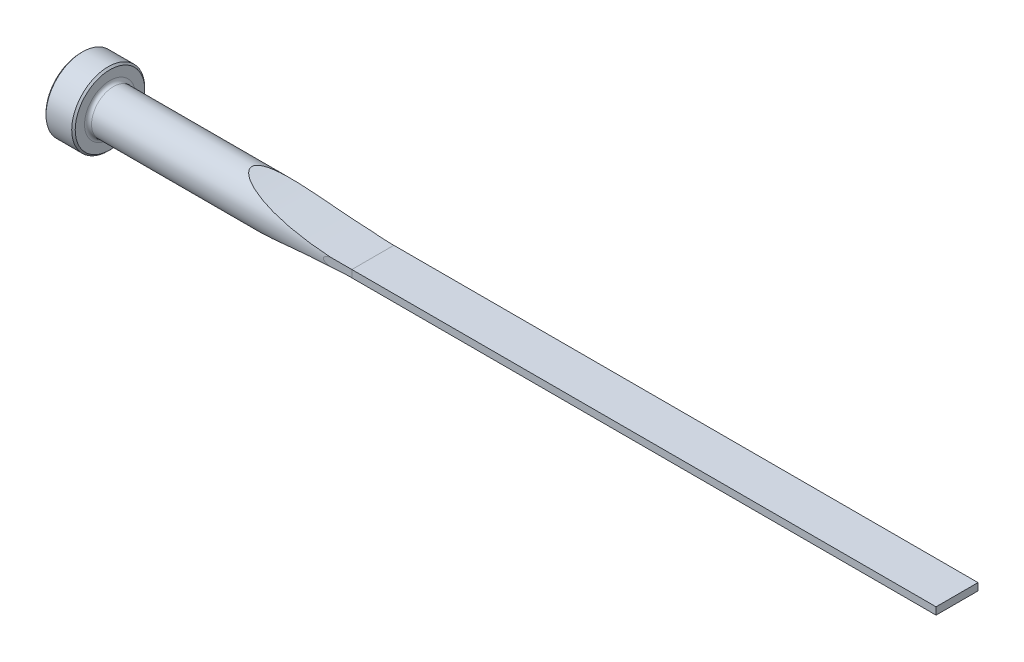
ISO-10303-21;
HEADER;
FILE_DESCRIPTION(('STEP AP214'),'2;1');
FILE_NAME('part.step','',(''),(''),'','','');
FILE_SCHEMA(('AUTOMOTIVE_DESIGN { 1 0 10303 214 1 1 1 1 }'));
ENDSEC;
DATA;
#1=APPLICATION_CONTEXT('core data for automotive mechanical design processes');
#2=APPLICATION_PROTOCOL_DEFINITION('international standard','automotive_design',2000,#1);
#3=PRODUCT_CONTEXT('',#1,'mechanical');
#4=PRODUCT('Part','Part','',(#3));
#5=PRODUCT_RELATED_PRODUCT_CATEGORY('part','',(#4));
#6=PRODUCT_DEFINITION_FORMATION('','',#4);
#7=PRODUCT_DEFINITION_CONTEXT('part definition',#1,'design');
#8=PRODUCT_DEFINITION('design','',#6,#7);
#9=PRODUCT_DEFINITION_SHAPE('','',#8);
#10=(LENGTH_UNIT() NAMED_UNIT(*) SI_UNIT(.MILLI.,.METRE.));
#11=(NAMED_UNIT(*) PLANE_ANGLE_UNIT() SI_UNIT($,.RADIAN.));
#12=(NAMED_UNIT(*) SI_UNIT($,.STERADIAN.) SOLID_ANGLE_UNIT());
#13=UNCERTAINTY_MEASURE_WITH_UNIT(LENGTH_MEASURE(1.E-05),#10,'distance_accuracy_value','');
#14=(GEOMETRIC_REPRESENTATION_CONTEXT(3) GLOBAL_UNCERTAINTY_ASSIGNED_CONTEXT((#13)) GLOBAL_UNIT_ASSIGNED_CONTEXT((#10,
#11,#12)) REPRESENTATION_CONTEXT('',''));
#15=CARTESIAN_POINT('',(0.,0.,0.));
#16=DIRECTION('',(0.,0.,1.));
#17=DIRECTION('',(1.,0.,0.));
#18=AXIS2_PLACEMENT_3D('',#15,#16,#17);
#19=CARTESIAN_POINT('',(0.,0.,0.));
#20=DIRECTION('',(-1.,0.,0.));
#21=DIRECTION('',(0.,0.,1.));
#22=AXIS2_PLACEMENT_3D('',#19,#20,#21);
#23=CYLINDRICAL_SURFACE('',#22,4.7625);
#24=CARTESIAN_POINT('',(7.112,0.,0.));
#25=DIRECTION('',(-1.,0.,0.));
#26=DIRECTION('',(0.,0.,1.));
#27=AXIS2_PLACEMENT_3D('',#24,#25,#26);
#28=CIRCLE('',#27,4.7625);
#29=CARTESIAN_POINT('',(7.112,0.,4.7625));
#30=VERTEX_POINT('',#29);
#31=EDGE_CURVE('E153',#30,#30,#28,.F.);
#32=ORIENTED_EDGE('',*,*,#31,.T.);
#33=EDGE_LOOP('',(#32));
#34=FACE_BOUND('',#33,.T.);
#35=CARTESIAN_POINT('',(63.5,1.37629566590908,4.55929999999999));
#36=CARTESIAN_POINT('',(63.300243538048,1.37627017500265,4.55929946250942));
#37=CARTESIAN_POINT('',(63.1004832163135,1.37406392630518,4.55997325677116));
#38=CARTESIAN_POINT('',(62.7010249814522,1.36511039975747,4.56266611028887));
#39=CARTESIAN_POINT('',(62.5013270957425,1.35836200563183,4.56468550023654));
#40=CARTESIAN_POINT('',(62.1003478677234,1.34006170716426,4.57009060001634));
#41=CARTESIAN_POINT('',(61.8990686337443,1.32846669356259,4.57348856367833));
#42=CARTESIAN_POINT('',(61.4969284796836,1.30007175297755,4.58164172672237));
#43=CARTESIAN_POINT('',(61.296067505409,1.28327254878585,4.58639673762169));
#44=CARTESIAN_POINT('',(60.8961767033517,1.2439534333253,4.59721659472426));
#45=CARTESIAN_POINT('',(60.6971431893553,1.22146913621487,4.6032732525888));
#46=CARTESIAN_POINT('',(60.2999040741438,1.16973426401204,4.61669265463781));
#47=CARTESIAN_POINT('',(60.1016988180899,1.14048110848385,4.62405589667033));
#48=CARTESIAN_POINT('',(59.7074850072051,1.07370926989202,4.64001372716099));
#49=CARTESIAN_POINT('',(59.5114710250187,1.03622172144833,4.64860363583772));
#50=CARTESIAN_POINT('',(59.1219644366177,0.950234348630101,4.66695416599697));
#51=CARTESIAN_POINT('',(58.9284697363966,0.901744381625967,4.67671373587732));
#52=CARTESIAN_POINT('',(58.689568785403,0.830609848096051,4.68952997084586));
#53=CARTESIAN_POINT('',(58.6417966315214,0.815810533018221,4.69213189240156));
#54=CARTESIAN_POINT('',(58.5466454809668,0.784967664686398,4.69739068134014));
#55=CARTESIAN_POINT('',(58.4992665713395,0.768923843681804,4.70004756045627));
#56=CARTESIAN_POINT('',(58.3571752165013,0.718404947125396,4.70812874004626));
#57=CARTESIAN_POINT('',(58.263234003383,0.681752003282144,4.71362458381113));
#58=CARTESIAN_POINT('',(58.0775344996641,0.599731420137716,4.72477713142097));
#59=CARTESIAN_POINT('',(57.9858203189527,0.554256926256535,4.73043499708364));
#60=CARTESIAN_POINT('',(57.8546141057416,0.476034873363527,4.73871868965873));
#61=CARTESIAN_POINT('',(57.8120990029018,0.448424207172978,4.7414354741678));
#62=CARTESIAN_POINT('',(57.7304247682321,0.388667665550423,4.74670987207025));
#63=CARTESIAN_POINT('',(57.6912549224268,0.356537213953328,4.74926798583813));
#64=CARTESIAN_POINT('',(57.6343845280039,0.30109449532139,4.75301502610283));
#65=CARTESIAN_POINT('',(57.6146643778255,0.279884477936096,4.75432176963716));
#66=CARTESIAN_POINT('',(57.578171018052,0.235020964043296,4.75675058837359));
#67=CARTESIAN_POINT('',(57.5613938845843,0.211370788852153,4.75787290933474));
#68=CARTESIAN_POINT('',(57.5361358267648,0.168085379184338,4.75956809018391));
#69=CARTESIAN_POINT('',(57.526635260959,0.149056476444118,4.76020769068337));
#70=CARTESIAN_POINT('',(57.51078402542,0.10971358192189,4.76127659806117));
#71=CARTESIAN_POINT('',(57.5044294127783,0.089401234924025,4.76170616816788));
#72=CARTESIAN_POINT('',(57.4955459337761,0.0476995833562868,4.76230708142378));
#73=CARTESIAN_POINT('',(57.4930580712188,0.0263011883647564,4.76247565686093));
#74=CARTESIAN_POINT('',(57.4924127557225,-0.0165581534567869,4.76251936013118));
#75=CARTESIAN_POINT('',(57.4942536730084,-0.0380190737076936,4.76239459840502));
#76=CARTESIAN_POINT('',(57.5014223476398,-0.0771509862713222,4.76190953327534));
#77=CARTESIAN_POINT('',(57.5062147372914,-0.0949256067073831,4.76158540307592));
#78=CARTESIAN_POINT('',(57.5183183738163,-0.129583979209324,4.76076832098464));
#79=CARTESIAN_POINT('',(57.5256312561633,-0.146467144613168,4.76027525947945));
#80=CARTESIAN_POINT('',(57.5478239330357,-0.190109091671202,4.75878258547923));
#81=CARTESIAN_POINT('',(57.564497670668,-0.215945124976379,4.75766444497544));
#82=CARTESIAN_POINT('',(57.6015159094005,-0.264813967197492,4.75519504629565));
#83=CARTESIAN_POINT('',(57.6218718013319,-0.28783769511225,4.75384306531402));
#84=CARTESIAN_POINT('',(57.6862463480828,-0.353109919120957,4.74959319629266));
#85=CARTESIAN_POINT('',(57.7337556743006,-0.391849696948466,4.74648889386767));
#86=CARTESIAN_POINT('',(57.8332528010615,-0.462955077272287,4.74007706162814));
#87=CARTESIAN_POINT('',(57.8852557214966,-0.495297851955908,4.73676885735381));
#88=CARTESIAN_POINT('',(58.0324605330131,-0.578484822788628,4.72754240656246));
#89=CARTESIAN_POINT('',(58.1303120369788,-0.624585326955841,4.72156110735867));
#90=CARTESIAN_POINT('',(58.3296567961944,-0.708279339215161,4.70972175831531));
#91=CARTESIAN_POINT('',(58.431158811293,-0.745850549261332,4.70386406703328));
#92=CARTESIAN_POINT('',(58.637175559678,-0.815246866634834,4.69233729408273));
#93=CARTESIAN_POINT('',(58.7417096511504,-0.84701459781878,4.68667050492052));
#94=CARTESIAN_POINT('',(58.9519315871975,-0.905852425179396,4.67565197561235));
#95=CARTESIAN_POINT('',(59.0576177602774,-0.932928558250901,4.67029983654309));
#96=CARTESIAN_POINT('',(59.3472077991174,-1.00180171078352,4.65615804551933));
#97=CARTESIAN_POINT('',(59.5319939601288,-1.03994988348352,4.64770520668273));
#98=CARTESIAN_POINT('',(59.9031150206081,-1.10820041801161,4.63190013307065));
#99=CARTESIAN_POINT('',(60.0894504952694,-1.13829964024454,4.62454832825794));
#100=CARTESIAN_POINT('',(60.4634968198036,-1.19209136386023,4.61097562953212));
#101=CARTESIAN_POINT('',(60.6512097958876,-1.21576959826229,4.60475726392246));
#102=CARTESIAN_POINT('',(61.0272867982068,-1.25764094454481,4.59349611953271));
#103=CARTESIAN_POINT('',(61.2156508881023,-1.2758335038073,4.58845345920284));
#104=CARTESIAN_POINT('',(61.7534776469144,-1.32086317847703,4.57577149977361));
#105=CARTESIAN_POINT('',(62.1034775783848,-1.34186157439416,4.56957976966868));
#106=CARTESIAN_POINT('',(62.628033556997,-1.36263417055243,4.56340533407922));
#107=CARTESIAN_POINT('',(62.8023917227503,-1.36777128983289,4.56186604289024));
#108=CARTESIAN_POINT('',(63.151163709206,-1.37459791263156,4.55981341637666));
#109=CARTESIAN_POINT('',(63.3255775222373,-1.37628777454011,4.55929997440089));
#110=CARTESIAN_POINT('',(63.4999999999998,-1.37629566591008,4.55929999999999));
#111=B_SPLINE_CURVE_WITH_KNOTS('',3,(#35,#36,#37,#38,#39,#40,#41,#42,#43,#44,#45,#46,#47,#48,
#49,#50,#51,#52,#53,#54,#55,#56,#57,#58,#59,#60,#61,#62,#63,#64,#65,#66,#67,#68,#69,#70,#71,#72,
#73,#74,#75,#76,#77,#78,#79,#80,#81,#82,#83,#84,#85,#86,#87,#88,#89,#90,#91,#92,#93,#94,#95,#96,
#97,#98,#99,#100,#101,#102,#103,#104,#105,#106,#107,#108,#109,#110),.UNSPECIFIED.,.F.,.F.,(4,2,
2,2,2,2,2,2,2,2,2,2,2,2,2,2,2,2,2,2,2,2,2,2,2,2,2,2,2,2,2,2,2,2,2,2,2,4),(0.,0.599262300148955,
1.19867192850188,1.80353056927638,2.40830524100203,3.00938132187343,3.6106869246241,
4.20975694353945,4.80829234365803,4.95851786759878,5.10877580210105,5.41155733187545,
5.71826557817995,5.87039269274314,6.0220127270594,6.10881533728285,6.19550132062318,
6.25911958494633,6.32265791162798,6.38686552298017,6.45104896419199,6.50606849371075,
6.56112379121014,6.65289509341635,6.74495530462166,6.92807013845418,7.11182707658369,
7.43597686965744,7.76096456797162,8.08900931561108,8.41662876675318,8.98296372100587,
9.54951926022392,10.1173235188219,10.6851849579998,11.7368092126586,12.2601040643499,
12.7833445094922),.UNSPECIFIED.);
#112=CARTESIAN_POINT('',(58.9480485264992,0.904013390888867,4.67591339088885));
#113=VERTEX_POINT('',#112);
#114=CARTESIAN_POINT('',(58.9480485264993,-0.904013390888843,4.67591339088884));
#115=VERTEX_POINT('',#114);
#116=EDGE_CURVE('E156',#113,#115,#111,.T.);
#117=ORIENTED_EDGE('',*,*,#116,.F.);
#118=CARTESIAN_POINT('',(63.5,0.787399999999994,4.69695725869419));
#119=CARTESIAN_POINT('',(63.103126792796,0.787399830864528,4.69694748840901));
#120=CARTESIAN_POINT('',(62.7062538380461,0.79005762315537,4.69651148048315));
#121=CARTESIAN_POINT('',(61.9125803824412,0.800687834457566,4.69471601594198));
#122=CARTESIAN_POINT('',(61.5157798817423,0.808660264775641,4.69335655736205));
#123=CARTESIAN_POINT('',(60.7222838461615,0.829919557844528,4.68964302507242));
#124=CARTESIAN_POINT('',(60.3255883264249,0.843206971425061,4.68728884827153));
#125=CARTESIAN_POINT('',(59.5324224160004,0.875093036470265,4.68143945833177));
#126=CARTESIAN_POINT('',(59.1359520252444,0.893691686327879,4.67794424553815));
#127=CARTESIAN_POINT('',(57.9438636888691,0.957617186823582,4.66543915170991));
#128=CARTESIAN_POINT('',(57.1486795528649,1.01099038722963,4.65442159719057));
#129=CARTESIAN_POINT('',(55.5602326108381,1.13907993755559,4.62473906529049));
#130=CARTESIAN_POINT('',(54.7669696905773,1.21379498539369,4.60607455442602));
#131=CARTESIAN_POINT('',(53.182688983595,1.3845232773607,4.55767834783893));
#132=CARTESIAN_POINT('',(52.3916723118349,1.48054568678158,4.5279418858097));
#133=CARTESIAN_POINT('',(51.2077910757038,1.64042239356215,4.47141725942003));
#134=CARTESIAN_POINT('',(50.8135579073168,1.69636273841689,4.45058587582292));
#135=CARTESIAN_POINT('',(50.0261561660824,1.81349066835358,4.40416166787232));
#136=CARTESIAN_POINT('',(49.6329875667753,1.87467812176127,4.3785689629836));
#137=CARTESIAN_POINT('',(48.848497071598,2.00216097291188,4.32176112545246));
#138=CARTESIAN_POINT('',(48.4571732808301,2.06844849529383,4.29055456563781));
#139=CARTESIAN_POINT('',(47.676034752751,2.20614832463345,4.22140449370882));
#140=CARTESIAN_POINT('',(47.2862199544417,2.27756042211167,4.18346125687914));
#141=CARTESIAN_POINT('',(46.5085584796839,2.42539507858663,4.09952338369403));
#142=CARTESIAN_POINT('',(46.1207111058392,2.50181570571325,4.05353184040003));
#143=CARTESIAN_POINT('',(45.3473087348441,2.65955660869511,3.95183266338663));
#144=CARTESIAN_POINT('',(44.9617535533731,2.74087648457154,3.89612582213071));
#145=CARTESIAN_POINT('',(44.1928102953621,2.9083843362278,3.77273832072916));
#146=CARTESIAN_POINT('',(43.8094278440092,2.9945814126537,3.70503473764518));
#147=CARTESIAN_POINT('',(43.0463625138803,3.17143580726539,3.5548452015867));
#148=CARTESIAN_POINT('',(42.6666812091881,3.26209493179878,3.47235322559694));
#149=CARTESIAN_POINT('',(42.1008164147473,3.4011157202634,3.33437538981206));
#150=CARTESIAN_POINT('',(41.9125521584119,3.44802685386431,3.28593425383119));
#151=CARTESIAN_POINT('',(41.537732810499,3.54271842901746,3.18361792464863));
#152=CARTESIAN_POINT('',(41.3511775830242,3.59049880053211,3.12974316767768));
#153=CARTESIAN_POINT('',(40.9803245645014,3.68675531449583,3.01575905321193));
#154=CARTESIAN_POINT('',(40.79602508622,3.73523086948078,2.9556547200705));
#155=CARTESIAN_POINT('',(40.430145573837,3.83271086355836,2.82810555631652));
#156=CARTESIAN_POINT('',(40.2485650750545,3.88171520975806,2.76066199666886));
#157=CARTESIAN_POINT('',(39.8871739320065,3.98045830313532,2.61631239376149));
#158=CARTESIAN_POINT('',(39.7073980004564,4.03019954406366,2.53932020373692));
#159=CARTESIAN_POINT('',(39.3526420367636,4.12953032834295,2.37437834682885));
#160=CARTESIAN_POINT('',(39.177666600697,4.17911968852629,2.28641859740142));
#161=CARTESIAN_POINT('',(38.8358677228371,4.27708511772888,2.09744100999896));
#162=CARTESIAN_POINT('',(38.6690004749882,4.32546680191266,1.99650748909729));
#163=CARTESIAN_POINT('',(38.4271094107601,4.39632633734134,1.83227615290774));
#164=CARTESIAN_POINT('',(38.3479421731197,4.41964226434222,1.77544571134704));
#165=CARTESIAN_POINT('',(38.1931579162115,4.46545300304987,1.65685775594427));
#166=CARTESIAN_POINT('',(38.1175398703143,4.48794805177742,1.59510168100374));
#167=CARTESIAN_POINT('',(37.938476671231,4.54146263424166,1.43743856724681));
#168=CARTESIAN_POINT('',(37.8374731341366,4.57186453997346,1.33848504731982));
#169=CARTESIAN_POINT('',(37.6499649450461,4.62862492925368,1.12659481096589));
#170=CARTESIAN_POINT('',(37.5634251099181,4.65499321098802,1.01369322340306));
#171=CARTESIAN_POINT('',(37.4392129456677,4.69299991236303,0.814563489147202));
#172=CARTESIAN_POINT('',(37.3950340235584,4.70656497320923,0.732811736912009));
#173=CARTESIAN_POINT('',(37.3192917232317,4.72986894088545,0.563081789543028));
#174=CARTESIAN_POINT('',(37.2877165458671,4.73961142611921,0.475109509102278));
#175=CARTESIAN_POINT('',(37.2400659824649,4.75432916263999,0.293471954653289));
#176=CARTESIAN_POINT('',(37.2241694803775,4.75924939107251,0.199753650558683));
#177=CARTESIAN_POINT('',(37.2106896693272,4.76342089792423,0.0109015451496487));
#178=CARTESIAN_POINT('',(37.213090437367,4.76267710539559,-0.0842309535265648));
#179=CARTESIAN_POINT('',(37.234131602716,4.75616762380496,-0.258394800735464));
#180=CARTESIAN_POINT('',(37.250370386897,4.75114463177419,-0.337763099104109));
#181=CARTESIAN_POINT('',(37.2943508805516,4.73756490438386,-0.492909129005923));
#182=CARTESIAN_POINT('',(37.3221007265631,4.72900566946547,-0.568684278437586));
#183=CARTESIAN_POINT('',(37.4031218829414,4.7040751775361,-0.751906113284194));
#184=CARTESIAN_POINT('',(37.4622289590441,4.6859335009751,-0.856509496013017));
#185=CARTESIAN_POINT('',(37.5952195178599,4.64530931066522,-1.05491221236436));
#186=CARTESIAN_POINT('',(37.6691435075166,4.62281490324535,-1.14868079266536));
#187=CARTESIAN_POINT('',(37.8191907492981,4.57740310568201,-1.31742992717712));
#188=CARTESIAN_POINT('',(37.8943568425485,4.55475237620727,-1.39335159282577));
#189=CARTESIAN_POINT('',(38.0507119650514,4.50788129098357,-1.5382513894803));
#190=CARTESIAN_POINT('',(38.1319061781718,4.48365958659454,-1.60722342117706));
#191=CARTESIAN_POINT('',(38.2989007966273,4.43411733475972,-1.73924931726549));
#192=CARTESIAN_POINT('',(38.3847104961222,4.40879459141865,-1.80229047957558));
#193=CARTESIAN_POINT('',(38.5596935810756,4.35745545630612,-1.92309340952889));
#194=CARTESIAN_POINT('',(38.6488657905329,4.33143930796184,-1.98085699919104));
#195=CARTESIAN_POINT('',(38.8737262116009,4.26623059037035,-2.11872774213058));
#196=CARTESIAN_POINT('',(39.0110117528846,4.22676330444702,-2.19609470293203));
#197=CARTESIAN_POINT('',(39.2898139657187,4.14736294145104,-2.34258733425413));
#198=CARTESIAN_POINT('',(39.4313327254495,4.10742964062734,-2.41170885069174));
#199=CARTESIAN_POINT('',(39.7177539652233,4.02739227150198,-2.5431168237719));
#200=CARTESIAN_POINT('',(39.8626618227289,3.98728802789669,-2.60539137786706));
#201=CARTESIAN_POINT('',(40.154926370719,3.90721286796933,-2.72400639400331));
#202=CARTESIAN_POINT('',(40.3022833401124,3.86724196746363,-2.78034617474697));
#203=CARTESIAN_POINT('',(40.5996982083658,3.78739993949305,-2.88817059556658));
#204=CARTESIAN_POINT('',(40.7497661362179,3.74753039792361,-2.93962861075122));
#205=CARTESIAN_POINT('',(41.0514912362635,3.66822312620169,-3.03801512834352));
#206=CARTESIAN_POINT('',(41.2031484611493,3.62878541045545,-3.08494348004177));
#207=CARTESIAN_POINT('',(41.5075991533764,3.55048002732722,-3.1747508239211));
#208=CARTESIAN_POINT('',(41.6603911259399,3.51161176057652,-3.21763437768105));
#209=CARTESIAN_POINT('',(41.9670707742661,3.43446981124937,-3.29984794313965));
#210=CARTESIAN_POINT('',(42.1209584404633,3.3961961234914,-3.33917798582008));
#211=CARTESIAN_POINT('',(42.556584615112,3.28909438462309,-3.44569297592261));
#212=CARTESIAN_POINT('',(42.8394124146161,3.22101794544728,-3.50919272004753));
#213=CARTESIAN_POINT('',(43.4074706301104,3.08725305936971,-3.62742706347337));
#214=CARTESIAN_POINT('',(43.6927013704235,3.02156494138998,-3.68216045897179));
#215=CARTESIAN_POINT('',(44.2651827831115,2.89271162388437,-3.7842280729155));
#216=CARTESIAN_POINT('',(44.5524343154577,2.8295475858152,-3.8315589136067));
#217=CARTESIAN_POINT('',(45.1284912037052,2.70588207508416,-3.91986956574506));
#218=CARTESIAN_POINT('',(45.4172966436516,2.64538074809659,-3.96084903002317));
#219=CARTESIAN_POINT('',(45.9968209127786,2.52699397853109,-4.03741107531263));
#220=CARTESIAN_POINT('',(46.2875425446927,2.46911454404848,-4.07298166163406));
#221=CARTESIAN_POINT('',(46.8700792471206,2.35616973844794,-4.13934179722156));
#222=CARTESIAN_POINT('',(47.1618943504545,2.30110445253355,-4.170131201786));
#223=CARTESIAN_POINT('',(48.0385734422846,2.1402285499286,-4.2562527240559));
#224=CARTESIAN_POINT('',(48.6248437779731,2.03870262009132,-4.30536014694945));
#225=CARTESIAN_POINT('',(49.8006018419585,1.84725202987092,-4.39090234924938));
#226=CARTESIAN_POINT('',(50.3900916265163,1.7573359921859,-4.42732774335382));
#227=CARTESIAN_POINT('',(51.5713012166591,1.5893181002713,-4.49038112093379));
#228=CARTESIAN_POINT('',(52.1630211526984,1.5112169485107,-4.51700852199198));
#229=CARTESIAN_POINT('',(53.3475151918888,1.36700248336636,-4.562720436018));
#230=CARTESIAN_POINT('',(53.940287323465,1.30087560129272,-4.58181351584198));
#231=CARTESIAN_POINT('',(55.1271692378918,1.18055571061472,-4.61427933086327));
#232=CARTESIAN_POINT('',(55.7212789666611,1.1263622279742,-4.62765229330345));
#233=CARTESIAN_POINT('',(56.91464366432,1.02960892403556,-4.65013911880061));
#234=CARTESIAN_POINT('',(57.5139058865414,0.987131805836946,-4.65922301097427));
#235=CARTESIAN_POINT('',(58.7133035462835,0.914326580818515,-4.67405513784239));
#236=CARTESIAN_POINT('',(59.3134391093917,0.884000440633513,-4.67980283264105));
#237=CARTESIAN_POINT('',(60.511243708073,0.835642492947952,-4.68867907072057));
#238=CARTESIAN_POINT('',(61.108910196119,0.817550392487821,-4.69182047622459));
#239=CARTESIAN_POINT('',(62.0055374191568,0.799459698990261,-4.69492298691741));
#240=CARTESIAN_POINT('',(62.3044106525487,0.794937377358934,-4.69568889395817));
#241=CARTESIAN_POINT('',(62.9021885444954,0.788907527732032,-4.69670485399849));
#242=CARTESIAN_POINT('',(63.201093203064,0.787400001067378,-4.69695490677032));
#243=CARTESIAN_POINT('',(63.5,0.787399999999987,-4.69695725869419));
#244=B_SPLINE_CURVE_WITH_KNOTS('',3,(#118,#119,#120,#121,#122,#123,#124,#125,#126,#127,#128,
#129,#130,#131,#132,#133,#134,#135,#136,#137,#138,#139,#140,#141,#142,#143,#144,#145,#146,#147,
#148,#149,#150,#151,#152,#153,#154,#155,#156,#157,#158,#159,#160,#161,#162,#163,#164,#165,#166,
#167,#168,#169,#170,#171,#172,#173,#174,#175,#176,#177,#178,#179,#180,#181,#182,#183,#184,#185,
#186,#187,#188,#189,#190,#191,#192,#193,#194,#195,#196,#197,#198,#199,#200,#201,#202,#203,#204,
#205,#206,#207,#208,#209,#210,#211,#212,#213,#214,#215,#216,#217,#218,#219,#220,#221,#222,#223,
#224,#225,#226,#227,#228,#229,#230,#231,#232,#233,#234,#235,#236,#237,#238,#239,#240,#241,#242,
#243),.UNSPECIFIED.,.F.,.F.,(4,2,2,2,2,2,2,2,2,2,2,2,2,2,2,2,2,2,2,2,2,2,2,2,2,2,2,2,2,2,2,2,2,
2,2,2,2,2,2,2,2,2,2,2,2,2,2,2,2,2,2,2,2,2,2,2,2,2,2,2,2,2,4),(0.,1.19060991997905,
2.38122237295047,3.57195824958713,4.76269376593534,7.1534979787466,9.54415635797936,
11.9358450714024,13.1319739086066,14.3280727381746,15.5223602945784,16.7165990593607,
17.9103798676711,19.1040633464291,20.3000527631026,21.496530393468,22.0963943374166,
22.6962101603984,23.2955459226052,23.8947780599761,24.4998747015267,25.1055317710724,
25.7074348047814,26.0078939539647,26.3082656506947,26.7411560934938,27.1729776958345,
27.4538131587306,27.7343850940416,28.0181223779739,28.3016127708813,28.5440574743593,
28.7866738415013,29.1491268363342,29.5125845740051,29.8397395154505,30.1671791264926,
30.4953047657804,30.8233166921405,31.3103109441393,31.7975495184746,32.2856221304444,
32.7737507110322,33.264404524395,33.7550746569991,34.2451846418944,34.7352903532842,
35.6283595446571,36.5215512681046,37.4151493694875,38.3087962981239,39.204396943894,
40.1000246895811,41.8907479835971,43.682793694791,45.4749459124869,47.2650544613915,
49.0550918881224,50.8574589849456,52.6601176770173,54.4538262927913,55.3505380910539,
56.2472502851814),.UNSPECIFIED.);
#245=CARTESIAN_POINT('',(58.9480485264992,0.904013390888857,-4.67591339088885));
#246=VERTEX_POINT('',#245);
#247=EDGE_CURVE('E106',#113,#246,#244,.T.);
#248=ORIENTED_EDGE('',*,*,#247,.T.);
#249=CARTESIAN_POINT('',(63.5,1.37629566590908,-4.55929999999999));
#250=CARTESIAN_POINT('',(63.3002435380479,1.37627017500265,-4.55929946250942));
#251=CARTESIAN_POINT('',(63.1004832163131,1.37406392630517,-4.55997325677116));
#252=CARTESIAN_POINT('',(62.7010249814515,1.36511039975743,-4.56266611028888));
#253=CARTESIAN_POINT('',(62.5013270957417,1.35836200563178,-4.56468550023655));
#254=CARTESIAN_POINT('',(62.1003478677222,1.34006170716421,-4.57009060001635));
#255=CARTESIAN_POINT('',(61.899068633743,1.32846669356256,-4.57348856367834));
#256=CARTESIAN_POINT('',(61.496928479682,1.30007175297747,-4.58164172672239));
#257=CARTESIAN_POINT('',(61.2960675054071,1.28327254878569,-4.58639673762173));
#258=CARTESIAN_POINT('',(60.8961767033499,1.2439534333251,-4.59721659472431));
#259=CARTESIAN_POINT('',(60.6971431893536,1.22146913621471,-4.60327325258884));
#260=CARTESIAN_POINT('',(60.2999040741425,1.16973426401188,-4.61669265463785));
#261=CARTESIAN_POINT('',(60.1016988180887,1.14048110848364,-4.62405589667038));
#262=CARTESIAN_POINT('',(59.7074850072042,1.07370926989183,-4.64001372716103));
#263=CARTESIAN_POINT('',(59.5114710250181,1.03622172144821,-4.64860363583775));
#264=CARTESIAN_POINT('',(59.1219644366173,0.950234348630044,-4.66695416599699));
#265=CARTESIAN_POINT('',(58.9284697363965,0.901744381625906,-4.67671373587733));
#266=CARTESIAN_POINT('',(58.689568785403,0.830609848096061,-4.68952997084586));
#267=CARTESIAN_POINT('',(58.6417966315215,0.815810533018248,-4.69213189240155));
#268=CARTESIAN_POINT('',(58.546645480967,0.784967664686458,-4.69739068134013));
#269=CARTESIAN_POINT('',(58.4992665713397,0.76892384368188,-4.70004756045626));
#270=CARTESIAN_POINT('',(58.3571752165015,0.718404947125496,-4.70812874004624));
#271=CARTESIAN_POINT('',(58.2632340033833,0.681752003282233,-4.71362458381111));
#272=CARTESIAN_POINT('',(58.0775344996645,0.599731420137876,-4.72477713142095));
#273=CARTESIAN_POINT('',(57.9858203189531,0.554256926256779,-4.73043499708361));
#274=CARTESIAN_POINT('',(57.8546141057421,0.476034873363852,-4.7387186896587));
#275=CARTESIAN_POINT('',(57.8120990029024,0.448424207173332,-4.74143547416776));
#276=CARTESIAN_POINT('',(57.7304247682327,0.388667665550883,-4.74670987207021));
#277=CARTESIAN_POINT('',(57.6912549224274,0.356537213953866,-4.74926798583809));
#278=CARTESIAN_POINT('',(57.6343845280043,0.301094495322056,-4.75301502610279));
#279=CARTESIAN_POINT('',(57.6146643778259,0.279884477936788,-4.75432176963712));
#280=CARTESIAN_POINT('',(57.5781710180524,0.235020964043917,-4.75675058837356));
#281=CARTESIAN_POINT('',(57.5613938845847,0.211370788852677,-4.75787290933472));
#282=CARTESIAN_POINT('',(57.5361358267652,0.168085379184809,-4.7595680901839));
#283=CARTESIAN_POINT('',(57.5266352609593,0.149056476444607,-4.76020769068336));
#284=CARTESIAN_POINT('',(57.5107840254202,0.109713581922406,-4.76127659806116));
#285=CARTESIAN_POINT('',(57.5044294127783,0.0894012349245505,-4.76170616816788));
#286=CARTESIAN_POINT('',(57.495545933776,0.0476995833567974,-4.76230708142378));
#287=CARTESIAN_POINT('',(57.4930580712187,0.026301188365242,-4.76247565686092));
#288=CARTESIAN_POINT('',(57.4924127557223,-0.0165581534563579,-4.76251936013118));
#289=CARTESIAN_POINT('',(57.4942536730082,-0.0380190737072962,-4.76239459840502));
#290=CARTESIAN_POINT('',(57.5014223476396,-0.0771509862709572,-4.76190953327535));
#291=CARTESIAN_POINT('',(57.5062147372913,-0.0949256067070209,-4.76158540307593));
#292=CARTESIAN_POINT('',(57.5183183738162,-0.129583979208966,-4.76076832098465));
#293=CARTESIAN_POINT('',(57.5256312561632,-0.146467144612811,-4.76027525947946));
#294=CARTESIAN_POINT('',(57.5478239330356,-0.190109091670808,-4.75878258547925));
#295=CARTESIAN_POINT('',(57.5644976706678,-0.215945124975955,-4.75766444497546));
#296=CARTESIAN_POINT('',(57.6015159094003,-0.264813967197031,-4.75519504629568));
#297=CARTESIAN_POINT('',(57.6218718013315,-0.287837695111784,-4.75384306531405));
#298=CARTESIAN_POINT('',(57.6862463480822,-0.353109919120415,-4.7495931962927));
#299=CARTESIAN_POINT('',(57.7337556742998,-0.391849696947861,-4.74648889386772));
#300=CARTESIAN_POINT('',(57.8332528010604,-0.462955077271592,-4.7400770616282));
#301=CARTESIAN_POINT('',(57.8852557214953,-0.495297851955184,-4.73676885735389));
#302=CARTESIAN_POINT('',(58.0324605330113,-0.578484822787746,-4.72754240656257));
#303=CARTESIAN_POINT('',(58.1303120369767,-0.624585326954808,-4.72156110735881));
#304=CARTESIAN_POINT('',(58.3296567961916,-0.708279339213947,-4.70972175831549));
#305=CARTESIAN_POINT('',(58.4311588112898,-0.74585054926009,-4.70386406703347));
#306=CARTESIAN_POINT('',(58.6371755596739,-0.815246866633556,-4.69233729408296));
#307=CARTESIAN_POINT('',(58.741709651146,-0.847014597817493,-4.68667050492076));
#308=CARTESIAN_POINT('',(58.9519315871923,-0.905852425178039,-4.67565197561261));
#309=CARTESIAN_POINT('',(59.0576177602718,-0.932928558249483,-4.67029983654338));
#310=CARTESIAN_POINT('',(59.3472077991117,-1.00180171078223,-4.65615804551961));
#311=CARTESIAN_POINT('',(59.5319939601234,-1.03994988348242,-4.64770520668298));
#312=CARTESIAN_POINT('',(59.9031150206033,-1.10820041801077,-4.63190013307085));
#313=CARTESIAN_POINT('',(60.0894504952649,-1.13829964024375,-4.62454832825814));
#314=CARTESIAN_POINT('',(60.4634968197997,-1.19209136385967,-4.61097562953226));
#315=CARTESIAN_POINT('',(60.651209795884,-1.21576959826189,-4.60475726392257));
#316=CARTESIAN_POINT('',(61.0272867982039,-1.25764094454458,-4.59349611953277));
#317=CARTESIAN_POINT('',(61.2156508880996,-1.27583350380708,-4.5884534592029));
#318=CARTESIAN_POINT('',(61.7534776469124,-1.32086317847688,-4.57577149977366));
#319=CARTESIAN_POINT('',(62.1034775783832,-1.34186157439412,-4.56957976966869));
#320=CARTESIAN_POINT('',(62.6280335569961,-1.36263417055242,-4.56340533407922));
#321=CARTESIAN_POINT('',(62.8023917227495,-1.36777128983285,-4.56186604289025));
#322=CARTESIAN_POINT('',(63.1511637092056,-1.37459791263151,-4.55981341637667));
#323=CARTESIAN_POINT('',(63.3255775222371,-1.37628777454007,-4.5592999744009));
#324=CARTESIAN_POINT('',(63.4999999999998,-1.37629566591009,-4.55929999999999));
#325=B_SPLINE_CURVE_WITH_KNOTS('',3,(#249,#250,#251,#252,#253,#254,#255,#256,#257,#258,#259,
#260,#261,#262,#263,#264,#265,#266,#267,#268,#269,#270,#271,#272,#273,#274,#275,#276,#277,#278,
#279,#280,#281,#282,#283,#284,#285,#286,#287,#288,#289,#290,#291,#292,#293,#294,#295,#296,#297,
#298,#299,#300,#301,#302,#303,#304,#305,#306,#307,#308,#309,#310,#311,#312,#313,#314,#315,#316,
#317,#318,#319,#320,#321,#322,#323,#324),.UNSPECIFIED.,.F.,.F.,(4,2,2,2,2,2,2,2,2,2,2,2,2,2,2,2,
2,2,2,2,2,2,2,2,2,2,2,2,2,2,2,2,2,2,2,2,2,4),(0.,0.599262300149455,1.19867192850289,
1.80353056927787,2.40830524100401,3.00938132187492,3.61068692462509,4.20975694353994,
4.80829234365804,4.95851786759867,5.10877580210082,5.41155733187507,5.71826557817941,
5.87039269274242,6.02201272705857,6.10881533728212,6.19550132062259,6.25911958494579,
6.32265791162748,6.38686552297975,6.45104896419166,6.50606849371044,6.56112379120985,
6.65289509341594,6.7449553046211,6.92807013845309,7.11182707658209,7.43597686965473,
7.7609645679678,8.08900931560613,8.4166287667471,8.98296372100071,9.54951926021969,
10.1173235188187,10.6851849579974,11.7368092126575,12.2601040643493,12.7833445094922),.UNSPECIFIED.);
#326=CARTESIAN_POINT('',(58.9480485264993,-0.904013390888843,-4.67591339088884));
#327=VERTEX_POINT('',#326);
#328=EDGE_CURVE('E175',#246,#327,#325,.T.);
#329=ORIENTED_EDGE('',*,*,#328,.T.);
#330=CARTESIAN_POINT('',(63.5,-0.787399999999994,4.69695725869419));
#331=CARTESIAN_POINT('',(63.1031267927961,-0.787399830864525,4.69694748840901));
#332=CARTESIAN_POINT('',(62.7062538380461,-0.790057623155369,4.69651148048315));
#333=CARTESIAN_POINT('',(61.9125803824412,-0.800687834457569,4.69471601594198));
#334=CARTESIAN_POINT('',(61.5157798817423,-0.808660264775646,4.69335655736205));
#335=CARTESIAN_POINT('',(60.7222838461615,-0.829919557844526,4.68964302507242));
#336=CARTESIAN_POINT('',(60.325588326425,-0.843206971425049,4.68728884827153));
#337=CARTESIAN_POINT('',(59.5324224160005,-0.875093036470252,4.68143945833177));
#338=CARTESIAN_POINT('',(59.1359520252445,-0.893691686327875,4.67794424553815));
#339=CARTESIAN_POINT('',(57.9438636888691,-0.957617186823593,4.66543915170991));
#340=CARTESIAN_POINT('',(57.148679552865,-1.01099038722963,4.65442159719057));
#341=CARTESIAN_POINT('',(55.5602326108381,-1.13907993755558,4.62473906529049));
#342=CARTESIAN_POINT('',(54.7669696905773,-1.21379498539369,4.60607455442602));
#343=CARTESIAN_POINT('',(53.182688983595,-1.3845232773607,4.55767834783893));
#344=CARTESIAN_POINT('',(52.3916723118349,-1.48054568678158,4.5279418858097));
#345=CARTESIAN_POINT('',(51.2077910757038,-1.64042239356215,4.47141725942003));
#346=CARTESIAN_POINT('',(50.8135579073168,-1.69636273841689,4.45058587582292));
#347=CARTESIAN_POINT('',(50.0261561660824,-1.81349066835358,4.40416166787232));
#348=CARTESIAN_POINT('',(49.6329875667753,-1.87467812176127,4.3785689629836));
#349=CARTESIAN_POINT('',(48.848497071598,-2.00216097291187,4.32176112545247));
#350=CARTESIAN_POINT('',(48.4571732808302,-2.06844849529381,4.29055456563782));
#351=CARTESIAN_POINT('',(47.676034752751,-2.20614832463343,4.22140449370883));
#352=CARTESIAN_POINT('',(47.2862199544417,-2.27756042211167,4.18346125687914));
#353=CARTESIAN_POINT('',(46.5085584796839,-2.42539507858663,4.09952338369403));
#354=CARTESIAN_POINT('',(46.1207111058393,-2.50181570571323,4.05353184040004));
#355=CARTESIAN_POINT('',(45.3473087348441,-2.65955660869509,3.95183266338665));
#356=CARTESIAN_POINT('',(44.9617535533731,-2.74087648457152,3.89612582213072));
#357=CARTESIAN_POINT('',(44.1928102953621,-2.90838433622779,3.77273832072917));
#358=CARTESIAN_POINT('',(43.8094278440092,-2.99458141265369,3.70503473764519));
#359=CARTESIAN_POINT('',(43.0463625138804,-3.17143580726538,3.55484520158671));
#360=CARTESIAN_POINT('',(42.6666812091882,-3.26209493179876,3.47235322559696));
#361=CARTESIAN_POINT('',(42.1008164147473,-3.40111572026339,3.33437538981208));
#362=CARTESIAN_POINT('',(41.9125521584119,-3.4480268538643,3.2859342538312));
#363=CARTESIAN_POINT('',(41.5377328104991,-3.54271842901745,3.18361792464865));
#364=CARTESIAN_POINT('',(41.3511775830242,-3.59049880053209,3.1297431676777));
#365=CARTESIAN_POINT('',(40.9803245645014,-3.68675531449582,3.01575905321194));
#366=CARTESIAN_POINT('',(40.79602508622,-3.73523086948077,2.95565472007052));
#367=CARTESIAN_POINT('',(40.4301455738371,-3.83271086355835,2.82810555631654));
#368=CARTESIAN_POINT('',(40.2485650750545,-3.88171520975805,2.76066199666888));
#369=CARTESIAN_POINT('',(39.8871739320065,-3.98045830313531,2.6163123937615));
#370=CARTESIAN_POINT('',(39.7073980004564,-4.03019954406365,2.53932020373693));
#371=CARTESIAN_POINT('',(39.3526420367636,-4.12953032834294,2.37437834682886));
#372=CARTESIAN_POINT('',(39.177666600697,-4.17911968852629,2.28641859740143));
#373=CARTESIAN_POINT('',(38.8358677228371,-4.27708511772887,2.09744100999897));
#374=CARTESIAN_POINT('',(38.6690004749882,-4.32546680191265,1.99650748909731));
#375=CARTESIAN_POINT('',(38.4271094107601,-4.39632633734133,1.83227615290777));
#376=CARTESIAN_POINT('',(38.3479421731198,-4.41964226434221,1.77544571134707));
#377=CARTESIAN_POINT('',(38.1931579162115,-4.46545300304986,1.6568577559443));
#378=CARTESIAN_POINT('',(38.1175398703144,-4.48794805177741,1.59510168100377));
#379=CARTESIAN_POINT('',(37.938476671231,-4.54146263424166,1.43743856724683));
#380=CARTESIAN_POINT('',(37.8374731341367,-4.57186453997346,1.33848504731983));
#381=CARTESIAN_POINT('',(37.6499649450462,-4.62862492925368,1.12659481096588));
#382=CARTESIAN_POINT('',(37.5634251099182,-4.65499321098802,1.01369322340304));
#383=CARTESIAN_POINT('',(37.4392129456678,-4.69299991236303,0.814563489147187));
#384=CARTESIAN_POINT('',(37.3950340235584,-4.70656497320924,0.732811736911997));
#385=CARTESIAN_POINT('',(37.3192917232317,-4.72986894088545,0.563081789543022));
#386=CARTESIAN_POINT('',(37.2877165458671,-4.73961142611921,0.475109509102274));
#387=CARTESIAN_POINT('',(37.2400659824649,-4.75432916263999,0.293471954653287));
#388=CARTESIAN_POINT('',(37.2241694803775,-4.75924939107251,0.19975365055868));
#389=CARTESIAN_POINT('',(37.2106896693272,-4.76342089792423,0.010901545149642));
#390=CARTESIAN_POINT('',(37.213090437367,-4.76267710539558,-0.0842309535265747));
#391=CARTESIAN_POINT('',(37.234131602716,-4.75616762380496,-0.258394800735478));
#392=CARTESIAN_POINT('',(37.250370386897,-4.75114463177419,-0.337763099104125));
#393=CARTESIAN_POINT('',(37.2943508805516,-4.73756490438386,-0.492909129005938));
#394=CARTESIAN_POINT('',(37.3221007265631,-4.72900566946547,-0.568684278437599));
#395=CARTESIAN_POINT('',(37.4031218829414,-4.70407517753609,-0.751906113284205));
#396=CARTESIAN_POINT('',(37.4622289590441,-4.68593350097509,-0.856509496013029));
#397=CARTESIAN_POINT('',(37.5952195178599,-4.64530931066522,-1.05491221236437));
#398=CARTESIAN_POINT('',(37.6691435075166,-4.62281490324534,-1.14868079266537));
#399=CARTESIAN_POINT('',(37.8191907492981,-4.577403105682,-1.31742992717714));
#400=CARTESIAN_POINT('',(37.8943568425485,-4.55475237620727,-1.39335159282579));
#401=CARTESIAN_POINT('',(38.0507119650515,-4.50788129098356,-1.53825138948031));
#402=CARTESIAN_POINT('',(38.1319061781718,-4.48365958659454,-1.60722342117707));
#403=CARTESIAN_POINT('',(38.2989007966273,-4.43411733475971,-1.7392493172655));
#404=CARTESIAN_POINT('',(38.3847104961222,-4.40879459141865,-1.80229047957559));
#405=CARTESIAN_POINT('',(38.5596935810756,-4.35745545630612,-1.9230934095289));
#406=CARTESIAN_POINT('',(38.6488657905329,-4.33143930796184,-1.98085699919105));
#407=CARTESIAN_POINT('',(38.8737262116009,-4.26623059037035,-2.11872774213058));
#408=CARTESIAN_POINT('',(39.0110117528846,-4.22676330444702,-2.19609470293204));
#409=CARTESIAN_POINT('',(39.2898139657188,-4.14736294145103,-2.34258733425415));
#410=CARTESIAN_POINT('',(39.4313327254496,-4.10742964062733,-2.41170885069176));
#411=CARTESIAN_POINT('',(39.7177539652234,-4.02739227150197,-2.54311682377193));
#412=CARTESIAN_POINT('',(39.8626618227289,-3.98728802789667,-2.60539137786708));
#413=CARTESIAN_POINT('',(40.1549263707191,-3.90721286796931,-2.72400639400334));
#414=CARTESIAN_POINT('',(40.3022833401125,-3.8672419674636,-2.78034617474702));
#415=CARTESIAN_POINT('',(40.5996982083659,-3.78739993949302,-2.88817059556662));
#416=CARTESIAN_POINT('',(40.749766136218,-3.74753039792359,-2.93962861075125));
#417=CARTESIAN_POINT('',(41.0514912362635,-3.66822312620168,-3.03801512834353));
#418=CARTESIAN_POINT('',(41.2031484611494,-3.62878541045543,-3.08494348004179));
#419=CARTESIAN_POINT('',(41.5075991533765,-3.55048002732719,-3.17475082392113));
#420=CARTESIAN_POINT('',(41.66039112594,-3.5116117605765,-3.21763437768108));
#421=CARTESIAN_POINT('',(41.9670707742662,-3.43446981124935,-3.29984794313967));
#422=CARTESIAN_POINT('',(42.1209584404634,-3.39619612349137,-3.3391779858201));
#423=CARTESIAN_POINT('',(42.5565846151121,-3.28909438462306,-3.44569297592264));
#424=CARTESIAN_POINT('',(42.8394124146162,-3.22101794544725,-3.50919272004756));
#425=CARTESIAN_POINT('',(43.4074706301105,-3.08725305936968,-3.62742706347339));
#426=CARTESIAN_POINT('',(43.6927013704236,-3.02156494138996,-3.68216045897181));
#427=CARTESIAN_POINT('',(44.2651827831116,-2.89271162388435,-3.78422807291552));
#428=CARTESIAN_POINT('',(44.5524343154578,-2.82954758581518,-3.83155891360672));
#429=CARTESIAN_POINT('',(45.1284912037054,-2.70588207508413,-3.91986956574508));
#430=CARTESIAN_POINT('',(45.4172966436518,-2.64538074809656,-3.96084903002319));
#431=CARTESIAN_POINT('',(45.9968209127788,-2.52699397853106,-4.03741107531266));
#432=CARTESIAN_POINT('',(46.2875425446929,-2.46911454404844,-4.07298166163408));
#433=CARTESIAN_POINT('',(46.8700792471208,-2.3561697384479,-4.13934179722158));
#434=CARTESIAN_POINT('',(47.1618943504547,-2.30110445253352,-4.17013120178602));
#435=CARTESIAN_POINT('',(48.0385734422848,-2.14022854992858,-4.25625272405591));
#436=CARTESIAN_POINT('',(48.6248437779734,-2.03870262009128,-4.30536014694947));
#437=CARTESIAN_POINT('',(49.8006018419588,-1.84725202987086,-4.39090234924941));
#438=CARTESIAN_POINT('',(50.3900916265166,-1.75733599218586,-4.42732774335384));
#439=CARTESIAN_POINT('',(51.5713012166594,-1.58931810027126,-4.4903811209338));
#440=CARTESIAN_POINT('',(52.1630211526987,-1.51121694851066,-4.517008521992));
#441=CARTESIAN_POINT('',(53.3475151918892,-1.36700248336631,-4.56272043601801));
#442=CARTESIAN_POINT('',(53.9402873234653,-1.30087560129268,-4.58181351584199));
#443=CARTESIAN_POINT('',(55.1271692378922,-1.18055571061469,-4.61427933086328));
#444=CARTESIAN_POINT('',(55.7212789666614,-1.12636222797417,-4.62765229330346));
#445=CARTESIAN_POINT('',(56.9146436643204,-1.02960892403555,-4.65013911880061));
#446=CARTESIAN_POINT('',(57.5139058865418,-0.987131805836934,-4.65922301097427));
#447=CARTESIAN_POINT('',(58.7133035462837,-0.914326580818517,-4.67405513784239));
#448=CARTESIAN_POINT('',(59.3134391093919,-0.884000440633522,-4.67980283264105));
#449=CARTESIAN_POINT('',(60.5112437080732,-0.835642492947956,-4.68867907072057));
#450=CARTESIAN_POINT('',(61.1089101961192,-0.817550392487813,-4.69182047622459));
#451=CARTESIAN_POINT('',(62.0055374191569,-0.79945969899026,-4.69492298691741));
#452=CARTESIAN_POINT('',(62.3044106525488,-0.794937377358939,-4.69568889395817));
#453=CARTESIAN_POINT('',(62.9021885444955,-0.788907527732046,-4.69670485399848));
#454=CARTESIAN_POINT('',(63.2010932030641,-0.787400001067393,-4.69695490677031));
#455=CARTESIAN_POINT('',(63.5,-0.787399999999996,-4.69695725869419));
#456=B_SPLINE_CURVE_WITH_KNOTS('',3,(#330,#331,#332,#333,#334,#335,#336,#337,#338,#339,#340,
#341,#342,#343,#344,#345,#346,#347,#348,#349,#350,#351,#352,#353,#354,#355,#356,#357,#358,#359,
#360,#361,#362,#363,#364,#365,#366,#367,#368,#369,#370,#371,#372,#373,#374,#375,#376,#377,#378,
#379,#380,#381,#382,#383,#384,#385,#386,#387,#388,#389,#390,#391,#392,#393,#394,#395,#396,#397,
#398,#399,#400,#401,#402,#403,#404,#405,#406,#407,#408,#409,#410,#411,#412,#413,#414,#415,#416,
#417,#418,#419,#420,#421,#422,#423,#424,#425,#426,#427,#428,#429,#430,#431,#432,#433,#434,#435,
#436,#437,#438,#439,#440,#441,#442,#443,#444,#445,#446,#447,#448,#449,#450,#451,#452,#453,#454,
#455),.UNSPECIFIED.,.F.,.F.,(4,2,2,2,2,2,2,2,2,2,2,2,2,2,2,2,2,2,2,2,2,2,2,2,2,2,2,2,2,2,2,2,2,
2,2,2,2,2,2,2,2,2,2,2,2,2,2,2,2,2,2,2,2,2,2,2,2,2,2,2,2,2,4),(0.,1.19060991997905,
2.38122237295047,3.57195824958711,4.76269376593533,7.1534979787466,9.54415635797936,
11.9358450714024,13.1319739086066,14.3280727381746,15.5223602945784,16.7165990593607,
17.9103798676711,19.1040633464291,20.3000527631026,21.496530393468,22.0963943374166,
22.6962101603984,23.2955459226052,23.8947780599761,24.4998747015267,25.1055317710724,
25.7074348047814,26.0078939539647,26.3082656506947,26.7411560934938,27.1729776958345,
27.4538131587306,27.7343850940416,28.018122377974,28.3016127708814,28.5440574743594,
28.7866738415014,29.1491268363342,29.5125845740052,29.8397395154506,30.1671791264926,
30.4953047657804,30.8233166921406,31.3103109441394,31.7975495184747,32.2856221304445,
32.7737507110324,33.2644045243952,33.7550746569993,34.2451846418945,34.7352903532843,
35.6283595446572,36.5215512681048,37.4151493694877,38.3087962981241,39.2043969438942,
40.1000246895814,41.8907479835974,43.6827936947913,45.4749459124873,47.2650544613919,
49.0550918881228,50.8574589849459,52.6601176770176,54.4538262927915,55.350538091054,
56.2472502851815),.UNSPECIFIED.);
#457=EDGE_CURVE('E105',#115,#327,#456,.T.);
#458=ORIENTED_EDGE('',*,*,#457,.F.);
#459=EDGE_LOOP('',(#117,#248,#329,#458));
#460=FACE_BOUND('',#459,.T.);
#461=ADVANCED_FACE('F33',(#34,#460),#23,.T.);
#462=CARTESIAN_POINT('',(190.5,4.7625,0.));
#463=DIRECTION('',(-1.,0.,0.));
#464=DIRECTION('',(0.,0.,1.));
#465=AXIS2_PLACEMENT_3D('',#462,#463,#464);
#466=PLANE('',#465);
#467=DIRECTION('',(0.,1.,0.));
#468=VECTOR('',#467,1.);
#469=CARTESIAN_POINT('',(190.5,-7.9375,4.5593));
#470=LINE('',#469,#468);
#471=CARTESIAN_POINT('',(190.5,-0.787400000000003,4.5593));
#472=VERTEX_POINT('',#471);
#473=CARTESIAN_POINT('',(190.5,0.787400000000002,4.5593));
#474=VERTEX_POINT('',#473);
#475=EDGE_CURVE('E87',#472,#474,#470,.T.);
#476=ORIENTED_EDGE('',*,*,#475,.F.);
#477=DIRECTION('',(0.,0.,1.));
#478=VECTOR('',#477,1.);
#479=CARTESIAN_POINT('',(190.5,-0.787400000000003,0.));
#480=LINE('',#479,#478);
#481=CARTESIAN_POINT('',(190.5,-0.787400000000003,-4.5593));
#482=VERTEX_POINT('',#481);
#483=EDGE_CURVE('E100',#482,#472,#480,.T.);
#484=ORIENTED_EDGE('',*,*,#483,.F.);
#485=DIRECTION('',(0.,1.,0.));
#486=VECTOR('',#485,1.);
#487=CARTESIAN_POINT('',(190.5,-7.9375,-4.5593));
#488=LINE('',#487,#486);
#489=CARTESIAN_POINT('',(190.5,0.787399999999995,-4.5593));
#490=VERTEX_POINT('',#489);
#491=EDGE_CURVE('E56',#482,#490,#488,.T.);
#492=ORIENTED_EDGE('',*,*,#491,.T.);
#493=DIRECTION('',(0.,0.,1.));
#494=VECTOR('',#493,1.);
#495=CARTESIAN_POINT('',(190.5,0.787400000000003,0.));
#496=LINE('',#495,#494);
#497=EDGE_CURVE('E102',#490,#474,#496,.T.);
#498=ORIENTED_EDGE('',*,*,#497,.T.);
#499=EDGE_LOOP('',(#476,#484,#492,#498));
#500=FACE_BOUND('',#499,.T.);
#501=ADVANCED_FACE('F99',(#500),#466,.F.);
#502=CARTESIAN_POINT('',(63.5,89.6874,-7.9375));
#503=DIRECTION('',(0.,0.,1.));
#504=DIRECTION('',(1.,0.,0.));
#505=AXIS2_PLACEMENT_3D('',#502,#503,#504);
#506=CYLINDRICAL_SURFACE('',#505,88.9);
#507=CARTESIAN_POINT('',(63.5,89.6874,93.4593));
#508=DIRECTION('',(0.,-0.707106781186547,0.707106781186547));
#509=DIRECTION('',(0.,0.707106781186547,0.707106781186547));
#510=AXIS2_PLACEMENT_3D('',#507,#508,#509);
#511=ELLIPSE('',#510,125.723585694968,88.9);
#512=CARTESIAN_POINT('',(63.5,0.787399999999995,4.55929999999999));
#513=VERTEX_POINT('',#512);
#514=EDGE_CURVE('E162',#513,#113,#511,.F.);
#515=ORIENTED_EDGE('',*,*,#514,.F.);
#516=DIRECTION('',(0.,0.,1.));
#517=VECTOR('',#516,1.);
#518=CARTESIAN_POINT('',(63.5,0.787399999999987,-7.9375));
#519=LINE('',#518,#517);
#520=CARTESIAN_POINT('',(63.5,0.787399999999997,-4.55929999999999));
#521=VERTEX_POINT('',#520);
#522=EDGE_CURVE('E170',#521,#513,#519,.T.);
#523=ORIENTED_EDGE('',*,*,#522,.F.);
#524=CARTESIAN_POINT('',(63.5,89.6874,-93.4593));
#525=DIRECTION('',(0.,0.707106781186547,0.707106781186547));
#526=DIRECTION('',(0.,-0.707106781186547,0.707106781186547));
#527=AXIS2_PLACEMENT_3D('',#524,#525,#526);
#528=ELLIPSE('',#527,125.723585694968,88.9);
#529=EDGE_CURVE('E169',#521,#246,#528,.F.);
#530=ORIENTED_EDGE('',*,*,#529,.T.);
#531=ORIENTED_EDGE('',*,*,#247,.F.);
#532=EDGE_LOOP('',(#515,#523,#530,#531));
#533=FACE_BOUND('',#532,.T.);
#534=ADVANCED_FACE('F138',(#533),#506,.F.);
#535=CARTESIAN_POINT('',(190.5,0.787400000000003,-7.9375));
#536=DIRECTION('',(0.,-1.,0.));
#537=DIRECTION('',(1.,0.,0.));
#538=AXIS2_PLACEMENT_3D('',#535,#536,#537);
#539=PLANE('',#538);
#540=DIRECTION('',(-1.,0.,0.));
#541=VECTOR('',#540,1.);
#542=CARTESIAN_POINT('',(190.5,0.787400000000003,4.5593));
#543=LINE('',#542,#541);
#544=EDGE_CURVE('E188',#474,#513,#543,.T.);
#545=ORIENTED_EDGE('',*,*,#544,.F.);
#546=ORIENTED_EDGE('',*,*,#497,.F.);
#547=DIRECTION('',(-1.,0.,0.));
#548=VECTOR('',#547,1.);
#549=CARTESIAN_POINT('',(190.5,0.787400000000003,-4.5593));
#550=LINE('',#549,#548);
#551=EDGE_CURVE('E174',#490,#521,#550,.T.);
#552=ORIENTED_EDGE('',*,*,#551,.T.);
#553=ORIENTED_EDGE('',*,*,#522,.T.);
#554=EDGE_LOOP('',(#545,#546,#552,#553));
#555=FACE_BOUND('',#554,.T.);
#556=ADVANCED_FACE('F129',(#555),#539,.F.);
#557=CARTESIAN_POINT('',(63.5,-89.6874,-7.9375));
#558=DIRECTION('',(0.,0.,1.));
#559=DIRECTION('',(1.,0.,0.));
#560=AXIS2_PLACEMENT_3D('',#557,#558,#559);
#561=CYLINDRICAL_SURFACE('',#560,88.9);
#562=DIRECTION('',(0.,0.,1.));
#563=VECTOR('',#562,1.);
#564=CARTESIAN_POINT('',(63.5,-0.787399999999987,-7.9375));
#565=LINE('',#564,#563);
#566=CARTESIAN_POINT('',(63.5,-0.787399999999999,-4.55929999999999));
#567=VERTEX_POINT('',#566);
#568=CARTESIAN_POINT('',(63.5,-0.787399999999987,4.5593));
#569=VERTEX_POINT('',#568);
#570=EDGE_CURVE('E178',#567,#569,#565,.T.);
#571=ORIENTED_EDGE('',*,*,#570,.T.);
#572=CARTESIAN_POINT('',(63.5,-89.6874,93.4593));
#573=DIRECTION('',(0.,0.707106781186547,0.707106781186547));
#574=DIRECTION('',(0.,-0.707106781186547,0.707106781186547));
#575=AXIS2_PLACEMENT_3D('',#572,#573,#574);
#576=ELLIPSE('',#575,125.723585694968,88.9);
#577=EDGE_CURVE('E163',#569,#115,#576,.T.);
#578=ORIENTED_EDGE('',*,*,#577,.T.);
#579=ORIENTED_EDGE('',*,*,#457,.T.);
#580=CARTESIAN_POINT('',(63.5,-89.6874,-93.4593));
#581=DIRECTION('',(0.,-0.707106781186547,0.707106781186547));
#582=DIRECTION('',(0.,0.707106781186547,0.707106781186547));
#583=AXIS2_PLACEMENT_3D('',#580,#581,#582);
#584=ELLIPSE('',#583,125.723585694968,88.9);
#585=EDGE_CURVE('E180',#567,#327,#584,.T.);
#586=ORIENTED_EDGE('',*,*,#585,.F.);
#587=EDGE_LOOP('',(#571,#578,#579,#586));
#588=FACE_BOUND('',#587,.T.);
#589=ADVANCED_FACE('F124',(#588),#561,.F.);
#590=CARTESIAN_POINT('',(190.5,-0.787400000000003,-7.9375));
#591=DIRECTION('',(0.,-1.,0.));
#592=DIRECTION('',(1.,0.,0.));
#593=AXIS2_PLACEMENT_3D('',#590,#591,#592);
#594=PLANE('',#593);
#595=ORIENTED_EDGE('',*,*,#483,.T.);
#596=DIRECTION('',(-1.,0.,0.));
#597=VECTOR('',#596,1.);
#598=CARTESIAN_POINT('',(190.5,-0.787400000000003,4.5593));
#599=LINE('',#598,#597);
#600=EDGE_CURVE('E84',#472,#569,#599,.T.);
#601=ORIENTED_EDGE('',*,*,#600,.T.);
#602=ORIENTED_EDGE('',*,*,#570,.F.);
#603=DIRECTION('',(-1.,0.,0.));
#604=VECTOR('',#603,1.);
#605=CARTESIAN_POINT('',(190.5,-0.787400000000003,-4.5593));
#606=LINE('',#605,#604);
#607=EDGE_CURVE('E94',#482,#567,#606,.T.);
#608=ORIENTED_EDGE('',*,*,#607,.F.);
#609=EDGE_LOOP('',(#595,#601,#602,#608));
#610=FACE_BOUND('',#609,.T.);
#611=ADVANCED_FACE('F104',(#610),#594,.T.);
#612=CARTESIAN_POINT('',(0.,0.,0.));
#613=DIRECTION('',(1.,0.,0.));
#614=DIRECTION('',(0.,0.,-1.));
#615=AXIS2_PLACEMENT_3D('',#612,#613,#614);
#616=PLANE('',#615);
#617=CARTESIAN_POINT('',(0.,0.,0.));
#618=DIRECTION('',(1.,0.,0.));
#619=DIRECTION('',(0.,0.,-1.));
#620=AXIS2_PLACEMENT_3D('',#617,#618,#619);
#621=CIRCLE('',#620,7.55649999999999);
#622=CARTESIAN_POINT('',(0.,0.,-7.55649999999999));
#623=VERTEX_POINT('',#622);
#624=EDGE_CURVE('E239',#623,#623,#621,.F.);
#625=ORIENTED_EDGE('',*,*,#624,.T.);
#626=EDGE_LOOP('',(#625));
#627=FACE_BOUND('',#626,.T.);
#628=ADVANCED_FACE('F136',(#627),#616,.F.);
#629=CARTESIAN_POINT('',(0.,0.,0.));
#630=DIRECTION('',(-1.,0.,0.));
#631=DIRECTION('',(0.,0.,1.));
#632=AXIS2_PLACEMENT_3D('',#629,#630,#631);
#633=CYLINDRICAL_SURFACE('',#632,7.9375);
#634=CARTESIAN_POINT('',(0.380999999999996,0.,0.));
#635=DIRECTION('',(1.,0.,0.));
#636=DIRECTION('',(0.,0.,-1.));
#637=AXIS2_PLACEMENT_3D('',#634,#635,#636);
#638=CIRCLE('',#637,7.9375);
#639=CARTESIAN_POINT('',(0.380999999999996,0.,-7.9375));
#640=VERTEX_POINT('',#639);
#641=EDGE_CURVE('E41',#640,#640,#638,.T.);
#642=ORIENTED_EDGE('',*,*,#641,.T.);
#643=EDGE_LOOP('',(#642));
#644=FACE_BOUND('',#643,.T.);
#645=CARTESIAN_POINT('',(5.96900000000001,0.,0.));
#646=DIRECTION('',(-1.,0.,0.));
#647=DIRECTION('',(0.,0.,1.));
#648=AXIS2_PLACEMENT_3D('',#645,#646,#647);
#649=CIRCLE('',#648,7.9375);
#650=CARTESIAN_POINT('',(5.96900000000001,0.,7.9375));
#651=VERTEX_POINT('',#650);
#652=EDGE_CURVE('E240',#651,#651,#649,.T.);
#653=ORIENTED_EDGE('',*,*,#652,.T.);
#654=EDGE_LOOP('',(#653));
#655=FACE_BOUND('',#654,.T.);
#656=ADVANCED_FACE('F213',(#644,#655),#633,.T.);
#657=CARTESIAN_POINT('',(6.35,7.9375,0.));
#658=DIRECTION('',(-1.,0.,0.));
#659=DIRECTION('',(0.,0.,1.));
#660=AXIS2_PLACEMENT_3D('',#657,#658,#659);
#661=PLANE('',#660);
#662=CARTESIAN_POINT('',(6.35,0.,0.));
#663=DIRECTION('',(-1.,0.,0.));
#664=DIRECTION('',(0.,0.,1.));
#665=AXIS2_PLACEMENT_3D('',#662,#663,#664);
#666=CIRCLE('',#665,7.55650000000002);
#667=CARTESIAN_POINT('',(6.35,0.,7.55650000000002));
#668=VERTEX_POINT('',#667);
#669=EDGE_CURVE('E11',#668,#668,#666,.F.);
#670=ORIENTED_EDGE('',*,*,#669,.T.);
#671=EDGE_LOOP('',(#670));
#672=FACE_BOUND('',#671,.T.);
#673=CARTESIAN_POINT('',(6.35,0.,0.));
#674=DIRECTION('',(-1.,0.,0.));
#675=DIRECTION('',(0.,0.,1.));
#676=AXIS2_PLACEMENT_3D('',#673,#674,#675);
#677=CIRCLE('',#676,5.5245);
#678=CARTESIAN_POINT('',(6.35,0.,5.5245));
#679=VERTEX_POINT('',#678);
#680=EDGE_CURVE('E93',#679,#679,#677,.T.);
#681=ORIENTED_EDGE('',*,*,#680,.T.);
#682=EDGE_LOOP('',(#681));
#683=FACE_BOUND('',#682,.T.);
#684=ADVANCED_FACE('F208',(#672,#683),#661,.F.);
#685=CARTESIAN_POINT('',(190.5,-7.9375,-4.5593));
#686=DIRECTION('',(0.,0.,1.));
#687=DIRECTION('',(1.,0.,0.));
#688=AXIS2_PLACEMENT_3D('',#685,#686,#687);
#689=PLANE('',#688);
#690=ORIENTED_EDGE('',*,*,#491,.F.);
#691=ORIENTED_EDGE('',*,*,#607,.T.);
#692=DIRECTION('',(0.,1.,0.));
#693=VECTOR('',#692,1.);
#694=CARTESIAN_POINT('',(63.5,-7.9375,-4.55929999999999));
#695=LINE('',#694,#693);
#696=EDGE_CURVE('E190',#567,#521,#695,.T.);
#697=ORIENTED_EDGE('',*,*,#696,.T.);
#698=ORIENTED_EDGE('',*,*,#551,.F.);
#699=EDGE_LOOP('',(#690,#691,#697,#698));
#700=FACE_BOUND('',#699,.T.);
#701=ADVANCED_FACE('F189',(#700),#689,.F.);
#702=CARTESIAN_POINT('',(63.5,-7.9375,-93.4593));
#703=DIRECTION('',(0.,1.,0.));
#704=DIRECTION('',(0.,0.,1.));
#705=AXIS2_PLACEMENT_3D('',#702,#703,#704);
#706=CYLINDRICAL_SURFACE('',#705,88.9);
#707=ORIENTED_EDGE('',*,*,#696,.F.);
#708=ORIENTED_EDGE('',*,*,#585,.T.);
#709=ORIENTED_EDGE('',*,*,#328,.F.);
#710=ORIENTED_EDGE('',*,*,#529,.F.);
#711=EDGE_LOOP('',(#707,#708,#709,#710));
#712=FACE_BOUND('',#711,.T.);
#713=ADVANCED_FACE('F131',(#712),#706,.F.);
#714=CARTESIAN_POINT('',(63.5,-7.9375,93.4593));
#715=DIRECTION('',(0.,1.,0.));
#716=DIRECTION('',(0.,0.,1.));
#717=AXIS2_PLACEMENT_3D('',#714,#715,#716);
#718=CYLINDRICAL_SURFACE('',#717,88.9);
#719=ORIENTED_EDGE('',*,*,#514,.T.);
#720=ORIENTED_EDGE('',*,*,#116,.T.);
#721=ORIENTED_EDGE('',*,*,#577,.F.);
#722=DIRECTION('',(0.,1.,0.));
#723=VECTOR('',#722,1.);
#724=CARTESIAN_POINT('',(63.5,-7.9375,4.55929999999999));
#725=LINE('',#724,#723);
#726=EDGE_CURVE('E48',#569,#513,#725,.T.);
#727=ORIENTED_EDGE('',*,*,#726,.T.);
#728=EDGE_LOOP('',(#719,#720,#721,#727));
#729=FACE_BOUND('',#728,.T.);
#730=ADVANCED_FACE('F201',(#729),#718,.F.);
#731=CARTESIAN_POINT('',(190.5,-7.9375,4.5593));
#732=DIRECTION('',(0.,0.,1.));
#733=DIRECTION('',(1.,0.,0.));
#734=AXIS2_PLACEMENT_3D('',#731,#732,#733);
#735=PLANE('',#734);
#736=ORIENTED_EDGE('',*,*,#544,.T.);
#737=ORIENTED_EDGE('',*,*,#726,.F.);
#738=ORIENTED_EDGE('',*,*,#600,.F.);
#739=ORIENTED_EDGE('',*,*,#475,.T.);
#740=EDGE_LOOP('',(#736,#737,#738,#739));
#741=FACE_BOUND('',#740,.T.);
#742=ADVANCED_FACE('F86',(#741),#735,.T.);
#743=CARTESIAN_POINT('',(7.112,0.,0.));
#744=DIRECTION('',(-1.,0.,0.));
#745=DIRECTION('',(0.,0.,1.));
#746=AXIS2_PLACEMENT_3D('',#743,#744,#745);
#747=TOROIDAL_SURFACE('',#746,5.5245,0.762);
#748=ORIENTED_EDGE('',*,*,#31,.F.);
#749=EDGE_LOOP('',(#748));
#750=FACE_BOUND('',#749,.T.);
#751=ORIENTED_EDGE('',*,*,#680,.F.);
#752=EDGE_LOOP('',(#751));
#753=FACE_BOUND('',#752,.T.);
#754=ADVANCED_FACE('F206',(#750,#753),#747,.F.);
#755=CARTESIAN_POINT('',(0.,0.,0.));
#756=DIRECTION('',(1.,0.,0.));
#757=DIRECTION('',(0.,0.,-1.));
#758=AXIS2_PLACEMENT_3D('',#755,#756,#757);
#759=CONICAL_SURFACE('',#758,7.55649999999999,0.785398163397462);
#760=ORIENTED_EDGE('',*,*,#641,.F.);
#761=EDGE_LOOP('',(#760));
#762=FACE_BOUND('',#761,.T.);
#763=ORIENTED_EDGE('',*,*,#624,.F.);
#764=EDGE_LOOP('',(#763));
#765=FACE_BOUND('',#764,.T.);
#766=ADVANCED_FACE('F226',(#762,#765),#759,.T.);
#767=CARTESIAN_POINT('',(5.96900000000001,0.,0.));
#768=DIRECTION('',(-1.,0.,0.));
#769=DIRECTION('',(0.,0.,1.));
#770=AXIS2_PLACEMENT_3D('',#767,#768,#769);
#771=CONICAL_SURFACE('',#770,7.9375,0.785398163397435);
#772=ORIENTED_EDGE('',*,*,#669,.F.);
#773=EDGE_LOOP('',(#772));
#774=FACE_BOUND('',#773,.T.);
#775=ORIENTED_EDGE('',*,*,#652,.F.);
#776=EDGE_LOOP('',(#775));
#777=FACE_BOUND('',#776,.T.);
#778=ADVANCED_FACE('F35',(#774,#777),#771,.T.);
#779=CLOSED_SHELL('',(#461,#501,#534,#556,#589,#611,#628,#656,#684,#701,#713,#730,#742,#754,
#766,#778));
#780=MANIFOLD_SOLID_BREP('B2',#779);
#781=ADVANCED_BREP_SHAPE_REPRESENTATION('',(#18,#780),#14);
#782=SHAPE_DEFINITION_REPRESENTATION(#9,#781);
ENDSEC;
END-ISO-10303-21;
